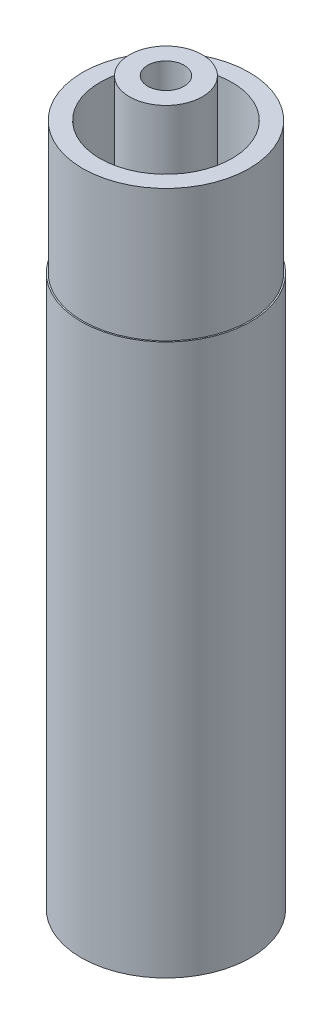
ISO-10303-21;
HEADER;
FILE_DESCRIPTION(('STEP AP214'),'2;1');
FILE_NAME('part.step','',(''),(''),'','','');
FILE_SCHEMA(('AUTOMOTIVE_DESIGN { 1 0 10303 214 1 1 1 1 }'));
ENDSEC;
DATA;
#1=APPLICATION_CONTEXT('core data for automotive mechanical design processes');
#2=APPLICATION_PROTOCOL_DEFINITION('international standard','automotive_design',2000,#1);
#3=PRODUCT_CONTEXT('',#1,'mechanical');
#4=PRODUCT('Part','Part','',(#3));
#5=PRODUCT_RELATED_PRODUCT_CATEGORY('part','',(#4));
#6=PRODUCT_DEFINITION_FORMATION('','',#4);
#7=PRODUCT_DEFINITION_CONTEXT('part definition',#1,'design');
#8=PRODUCT_DEFINITION('design','',#6,#7);
#9=PRODUCT_DEFINITION_SHAPE('','',#8);
#10=(LENGTH_UNIT() NAMED_UNIT(*) SI_UNIT(.MILLI.,.METRE.));
#11=(NAMED_UNIT(*) PLANE_ANGLE_UNIT() SI_UNIT($,.RADIAN.));
#12=(NAMED_UNIT(*) SI_UNIT($,.STERADIAN.) SOLID_ANGLE_UNIT());
#13=UNCERTAINTY_MEASURE_WITH_UNIT(LENGTH_MEASURE(1.E-05),#10,'distance_accuracy_value','');
#14=(GEOMETRIC_REPRESENTATION_CONTEXT(3) GLOBAL_UNCERTAINTY_ASSIGNED_CONTEXT((#13)) GLOBAL_UNIT_ASSIGNED_CONTEXT((#10,
#11,#12)) REPRESENTATION_CONTEXT('',''));
#15=CARTESIAN_POINT('',(0.,0.,0.));
#16=DIRECTION('',(0.,0.,1.));
#17=DIRECTION('',(1.,0.,0.));
#18=AXIS2_PLACEMENT_3D('',#15,#16,#17);
#19=CARTESIAN_POINT('',(0.,0.,0.));
#20=DIRECTION('',(0.,1.,0.));
#21=DIRECTION('',(0.,0.,1.));
#22=AXIS2_PLACEMENT_3D('',#19,#20,#21);
#23=CYLINDRICAL_SURFACE('',#22,2.2733);
#24=CARTESIAN_POINT('',(0.,0.,0.));
#25=DIRECTION('',(0.,1.,0.));
#26=DIRECTION('',(0.,0.,1.));
#27=AXIS2_PLACEMENT_3D('',#24,#25,#26);
#28=CIRCLE('',#27,2.2733);
#29=CARTESIAN_POINT('',(0.,0.,2.2733));
#30=VERTEX_POINT('',#29);
#31=EDGE_CURVE('E11',#30,#30,#28,.T.);
#32=ORIENTED_EDGE('',*,*,#31,.F.);
#33=EDGE_LOOP('',(#32));
#34=FACE_BOUND('',#33,.T.);
#35=CARTESIAN_POINT('',(0.,6.35,0.));
#36=DIRECTION('',(0.,1.,0.));
#37=DIRECTION('',(-1.,0.,0.));
#38=AXIS2_PLACEMENT_3D('',#35,#36,#37);
#39=CIRCLE('',#38,2.2733);
#40=CARTESIAN_POINT('',(-2.2733,6.35,0.));
#41=VERTEX_POINT('',#40);
#42=EDGE_CURVE('E41',#41,#41,#39,.T.);
#43=ORIENTED_EDGE('',*,*,#42,.T.);
#44=EDGE_LOOP('',(#43));
#45=FACE_BOUND('',#44,.T.);
#46=ADVANCED_FACE('F38',(#34,#45),#23,.F.);
#47=CARTESIAN_POINT('',(0.,28.1030975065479,0.));
#48=DIRECTION('',(0.,1.,0.));
#49=DIRECTION('',(0.,0.,1.));
#50=AXIS2_PLACEMENT_3D('',#47,#48,#49);
#51=CIRCLE('',#50,2.2733);
#52=CARTESIAN_POINT('',(0.,28.1030975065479,2.2733));
#53=VERTEX_POINT('',#52);
#54=EDGE_CURVE('E80',#53,#53,#51,.T.);
#55=ORIENTED_EDGE('',*,*,#54,.T.);
#56=EDGE_LOOP('',(#55));
#57=FACE_BOUND('',#56,.T.);
#58=CARTESIAN_POINT('',(0.,10.8348736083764,0.));
#59=DIRECTION('',(0.,-1.,0.));
#60=DIRECTION('',(1.,0.,0.));
#61=AXIS2_PLACEMENT_3D('',#58,#59,#60);
#62=CIRCLE('',#61,2.2733);
#63=CARTESIAN_POINT('',(2.2733,10.8348736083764,0.));
#64=VERTEX_POINT('',#63);
#65=EDGE_CURVE('E81',#64,#64,#62,.T.);
#66=ORIENTED_EDGE('',*,*,#65,.T.);
#67=EDGE_LOOP('',(#66));
#68=FACE_BOUND('',#67,.T.);
#69=ADVANCED_FACE('F68',(#57,#68),#23,.F.);
#70=CARTESIAN_POINT('',(-2.2733,0.,0.));
#71=DIRECTION('',(0.,-1.,0.));
#72=DIRECTION('',(0.,0.,-1.));
#73=AXIS2_PLACEMENT_3D('',#70,#71,#72);
#74=PLANE('',#73);
#75=ORIENTED_EDGE('',*,*,#31,.T.);
#76=EDGE_LOOP('',(#75));
#77=FACE_BOUND('',#76,.T.);
#78=CARTESIAN_POINT('',(0.,0.,0.));
#79=DIRECTION('',(0.,1.,0.));
#80=DIRECTION('',(0.,0.,1.));
#81=AXIS2_PLACEMENT_3D('',#78,#79,#80);
#82=CIRCLE('',#81,4.7244);
#83=CARTESIAN_POINT('',(0.,0.,4.7244));
#84=VERTEX_POINT('',#83);
#85=EDGE_CURVE('E46',#84,#84,#82,.T.);
#86=ORIENTED_EDGE('',*,*,#85,.F.);
#87=EDGE_LOOP('',(#86));
#88=FACE_BOUND('',#87,.T.);
#89=ADVANCED_FACE('F73',(#77,#88),#74,.T.);
#90=CARTESIAN_POINT('',(0.,0.,0.));
#91=DIRECTION('',(0.,1.,0.));
#92=DIRECTION('',(0.,0.,1.));
#93=AXIS2_PLACEMENT_3D('',#90,#91,#92);
#94=CYLINDRICAL_SURFACE('',#93,4.7244);
#95=ORIENTED_EDGE('',*,*,#85,.T.);
#96=EDGE_LOOP('',(#95));
#97=FACE_BOUND('',#96,.T.);
#98=CARTESIAN_POINT('',(0.,30.734,0.));
#99=DIRECTION('',(0.,1.,0.));
#100=DIRECTION('',(0.,0.,1.));
#101=AXIS2_PLACEMENT_3D('',#98,#99,#100);
#102=CIRCLE('',#101,4.7244);
#103=CARTESIAN_POINT('',(0.,30.734,4.7244));
#104=VERTEX_POINT('',#103);
#105=EDGE_CURVE('E93',#104,#104,#102,.T.);
#106=ORIENTED_EDGE('',*,*,#105,.F.);
#107=EDGE_LOOP('',(#106));
#108=FACE_BOUND('',#107,.T.);
#109=ADVANCED_FACE('F159',(#97,#108),#94,.T.);
#110=CARTESIAN_POINT('',(-4.7244,30.734,0.));
#111=DIRECTION('',(0.,1.,0.));
#112=DIRECTION('',(0.,0.,1.));
#113=AXIS2_PLACEMENT_3D('',#110,#111,#112);
#114=PLANE('',#113);
#115=ORIENTED_EDGE('',*,*,#105,.T.);
#116=EDGE_LOOP('',(#115));
#117=FACE_BOUND('',#116,.T.);
#118=CARTESIAN_POINT('',(0.,30.734,0.));
#119=DIRECTION('',(0.,1.,0.));
#120=DIRECTION('',(0.,0.,1.));
#121=AXIS2_PLACEMENT_3D('',#118,#119,#120);
#122=CIRCLE('',#121,4.6482);
#123=CARTESIAN_POINT('',(0.,30.734,4.6482));
#124=VERTEX_POINT('',#123);
#125=EDGE_CURVE('E97',#124,#124,#122,.T.);
#126=ORIENTED_EDGE('',*,*,#125,.F.);
#127=EDGE_LOOP('',(#126));
#128=FACE_BOUND('',#127,.T.);
#129=ADVANCED_FACE('F155',(#117,#128),#114,.T.);
#130=CARTESIAN_POINT('',(0.,0.,0.));
#131=DIRECTION('',(0.,1.,0.));
#132=DIRECTION('',(0.,0.,1.));
#133=AXIS2_PLACEMENT_3D('',#130,#131,#132);
#134=CYLINDRICAL_SURFACE('',#133,4.6482);
#135=ORIENTED_EDGE('',*,*,#125,.T.);
#136=EDGE_LOOP('',(#135));
#137=FACE_BOUND('',#136,.T.);
#138=CARTESIAN_POINT('',(0.,38.1,0.));
#139=DIRECTION('',(0.,1.,0.));
#140=DIRECTION('',(0.,0.,1.));
#141=AXIS2_PLACEMENT_3D('',#138,#139,#140);
#142=CIRCLE('',#141,4.6482);
#143=CARTESIAN_POINT('',(0.,38.1,4.6482));
#144=VERTEX_POINT('',#143);
#145=EDGE_CURVE('E101',#144,#144,#142,.T.);
#146=ORIENTED_EDGE('',*,*,#145,.F.);
#147=EDGE_LOOP('',(#146));
#148=FACE_BOUND('',#147,.T.);
#149=ADVANCED_FACE('F151',(#137,#148),#134,.T.);
#150=CARTESIAN_POINT('',(-4.6482,38.1,0.));
#151=DIRECTION('',(0.,1.,0.));
#152=DIRECTION('',(0.,0.,1.));
#153=AXIS2_PLACEMENT_3D('',#150,#151,#152);
#154=PLANE('',#153);
#155=ORIENTED_EDGE('',*,*,#145,.T.);
#156=EDGE_LOOP('',(#155));
#157=FACE_BOUND('',#156,.T.);
#158=CARTESIAN_POINT('',(0.,38.1,0.));
#159=DIRECTION('',(0.,1.,0.));
#160=DIRECTION('',(0.,0.,1.));
#161=AXIS2_PLACEMENT_3D('',#158,#159,#160);
#162=CIRCLE('',#161,3.683);
#163=CARTESIAN_POINT('',(0.,38.1,3.683));
#164=VERTEX_POINT('',#163);
#165=EDGE_CURVE('E104',#164,#164,#162,.T.);
#166=ORIENTED_EDGE('',*,*,#165,.F.);
#167=EDGE_LOOP('',(#166));
#168=FACE_BOUND('',#167,.T.);
#169=ADVANCED_FACE('F147',(#157,#168),#154,.T.);
#170=CARTESIAN_POINT('',(0.,0.,0.));
#171=DIRECTION('',(0.,1.,0.));
#172=DIRECTION('',(0.,0.,1.));
#173=AXIS2_PLACEMENT_3D('',#170,#171,#172);
#174=CYLINDRICAL_SURFACE('',#173,3.683);
#175=ORIENTED_EDGE('',*,*,#165,.T.);
#176=EDGE_LOOP('',(#175));
#177=FACE_BOUND('',#176,.T.);
#178=CARTESIAN_POINT('',(0.,30.734,0.));
#179=DIRECTION('',(0.,1.,0.));
#180=DIRECTION('',(0.,0.,1.));
#181=AXIS2_PLACEMENT_3D('',#178,#179,#180);
#182=CIRCLE('',#181,3.683);
#183=CARTESIAN_POINT('',(0.,30.734,3.683));
#184=VERTEX_POINT('',#183);
#185=EDGE_CURVE('E107',#184,#184,#182,.T.);
#186=ORIENTED_EDGE('',*,*,#185,.F.);
#187=EDGE_LOOP('',(#186));
#188=FACE_BOUND('',#187,.T.);
#189=ADVANCED_FACE('F143',(#177,#188),#174,.F.);
#190=CARTESIAN_POINT('',(-3.683,30.734,0.));
#191=DIRECTION('',(0.,1.,0.));
#192=DIRECTION('',(0.,0.,1.));
#193=AXIS2_PLACEMENT_3D('',#190,#191,#192);
#194=PLANE('',#193);
#195=ORIENTED_EDGE('',*,*,#185,.T.);
#196=EDGE_LOOP('',(#195));
#197=FACE_BOUND('',#196,.T.);
#198=CARTESIAN_POINT('',(0.,30.734,0.));
#199=DIRECTION('',(0.,1.,0.));
#200=DIRECTION('',(0.,0.,1.));
#201=AXIS2_PLACEMENT_3D('',#198,#199,#200);
#202=CIRCLE('',#201,2.032);
#203=CARTESIAN_POINT('',(0.,30.734,2.032));
#204=VERTEX_POINT('',#203);
#205=EDGE_CURVE('E111',#204,#204,#202,.T.);
#206=ORIENTED_EDGE('',*,*,#205,.F.);
#207=EDGE_LOOP('',(#206));
#208=FACE_BOUND('',#207,.T.);
#209=ADVANCED_FACE('F139',(#197,#208),#194,.T.);
#210=CARTESIAN_POINT('',(0.,0.,0.));
#211=DIRECTION('',(0.,1.,0.));
#212=DIRECTION('',(0.,0.,1.));
#213=AXIS2_PLACEMENT_3D('',#210,#211,#212);
#214=CYLINDRICAL_SURFACE('',#213,2.032);
#215=ORIENTED_EDGE('',*,*,#205,.T.);
#216=EDGE_LOOP('',(#215));
#217=FACE_BOUND('',#216,.T.);
#218=CARTESIAN_POINT('',(0.,40.259,0.));
#219=DIRECTION('',(0.,1.,0.));
#220=DIRECTION('',(0.,0.,1.));
#221=AXIS2_PLACEMENT_3D('',#218,#219,#220);
#222=CIRCLE('',#221,2.032);
#223=CARTESIAN_POINT('',(0.,40.259,2.032));
#224=VERTEX_POINT('',#223);
#225=EDGE_CURVE('E115',#224,#224,#222,.T.);
#226=ORIENTED_EDGE('',*,*,#225,.F.);
#227=EDGE_LOOP('',(#226));
#228=FACE_BOUND('',#227,.T.);
#229=ADVANCED_FACE('F133',(#217,#228),#214,.T.);
#230=CARTESIAN_POINT('',(-2.032,40.259,0.));
#231=DIRECTION('',(0.,1.,0.));
#232=DIRECTION('',(0.,0.,1.));
#233=AXIS2_PLACEMENT_3D('',#230,#231,#232);
#234=PLANE('',#233);
#235=ORIENTED_EDGE('',*,*,#225,.T.);
#236=EDGE_LOOP('',(#235));
#237=FACE_BOUND('',#236,.T.);
#238=CARTESIAN_POINT('',(0.,40.259,0.));
#239=DIRECTION('',(0.,1.,0.));
#240=DIRECTION('',(0.,0.,1.));
#241=AXIS2_PLACEMENT_3D('',#238,#239,#240);
#242=CIRCLE('',#241,1.016);
#243=CARTESIAN_POINT('',(0.,40.259,1.016));
#244=VERTEX_POINT('',#243);
#245=EDGE_CURVE('E118',#244,#244,#242,.T.);
#246=ORIENTED_EDGE('',*,*,#245,.F.);
#247=EDGE_LOOP('',(#246));
#248=FACE_BOUND('',#247,.T.);
#249=ADVANCED_FACE('F127',(#237,#248),#234,.T.);
#250=CARTESIAN_POINT('',(0.,0.,0.));
#251=DIRECTION('',(0.,1.,0.));
#252=DIRECTION('',(0.,0.,1.));
#253=AXIS2_PLACEMENT_3D('',#250,#251,#252);
#254=CYLINDRICAL_SURFACE('',#253,1.016);
#255=ORIENTED_EDGE('',*,*,#245,.T.);
#256=EDGE_LOOP('',(#255));
#257=FACE_BOUND('',#256,.T.);
#258=CARTESIAN_POINT('',(0.,28.829,0.));
#259=DIRECTION('',(0.,1.,0.));
#260=DIRECTION('',(0.,0.,1.));
#261=AXIS2_PLACEMENT_3D('',#258,#259,#260);
#262=CIRCLE('',#261,1.016);
#263=CARTESIAN_POINT('',(0.,28.829,1.016));
#264=VERTEX_POINT('',#263);
#265=EDGE_CURVE('E86',#264,#264,#262,.T.);
#266=ORIENTED_EDGE('',*,*,#265,.F.);
#267=EDGE_LOOP('',(#266));
#268=FACE_BOUND('',#267,.T.);
#269=ADVANCED_FACE('F63',(#257,#268),#254,.F.);
#270=CARTESIAN_POINT('',(0.,28.1030975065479,0.));
#271=DIRECTION('',(0.,-1.,0.));
#272=DIRECTION('',(0.,0.,-1.));
#273=AXIS2_PLACEMENT_3D('',#270,#271,#272);
#274=CONICAL_SURFACE('',#273,2.2733,1.0471975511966);
#275=ORIENTED_EDGE('',*,*,#265,.T.);
#276=EDGE_LOOP('',(#275));
#277=FACE_BOUND('',#276,.T.);
#278=ORIENTED_EDGE('',*,*,#54,.F.);
#279=EDGE_LOOP('',(#278));
#280=FACE_BOUND('',#279,.T.);
#281=ADVANCED_FACE('F54',(#277,#280),#274,.F.);
#282=CARTESIAN_POINT('',(0.,11.6622871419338,0.));
#283=DIRECTION('',(0.,-1.,0.));
#284=DIRECTION('',(1.,0.,0.));
#285=AXIS2_PLACEMENT_3D('',#282,#283,#284);
#286=CONICAL_SURFACE('',#285,0.,1.22173047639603);
#287=ORIENTED_EDGE('',*,*,#65,.F.);
#288=EDGE_LOOP('',(#287));
#289=FACE_BOUND('',#288,.T.);
#290=CARTESIAN_POINT('',(0.,11.6622871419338,0.));
#291=VERTEX_POINT('',#290);
#292=VERTEX_LOOP('',#291);
#293=FACE_BOUND('',#292,.T.);
#294=ADVANCED_FACE('F51',(#289,#293),#286,.T.);
#295=CARTESIAN_POINT('',(-4.1275,6.35,0.));
#296=DIRECTION('',(0.,1.,0.));
#297=DIRECTION('',(-1.,0.,0.));
#298=AXIS2_PLACEMENT_3D('',#295,#296,#297);
#299=PLANE('',#298);
#300=ORIENTED_EDGE('',*,*,#42,.F.);
#301=EDGE_LOOP('',(#300));
#302=FACE_BOUND('',#301,.T.);
#303=ADVANCED_FACE('F53',(#302),#299,.F.);
#304=CLOSED_SHELL('',(#46,#69,#89,#109,#129,#149,#169,#189,#209,#229,#249,#269,#281,#294,#303));
#305=MANIFOLD_SOLID_BREP('B2',#304);
#306=ADVANCED_BREP_SHAPE_REPRESENTATION('',(#18,#305),#14);
#307=SHAPE_DEFINITION_REPRESENTATION(#9,#306);
ENDSEC;
END-ISO-10303-21;
